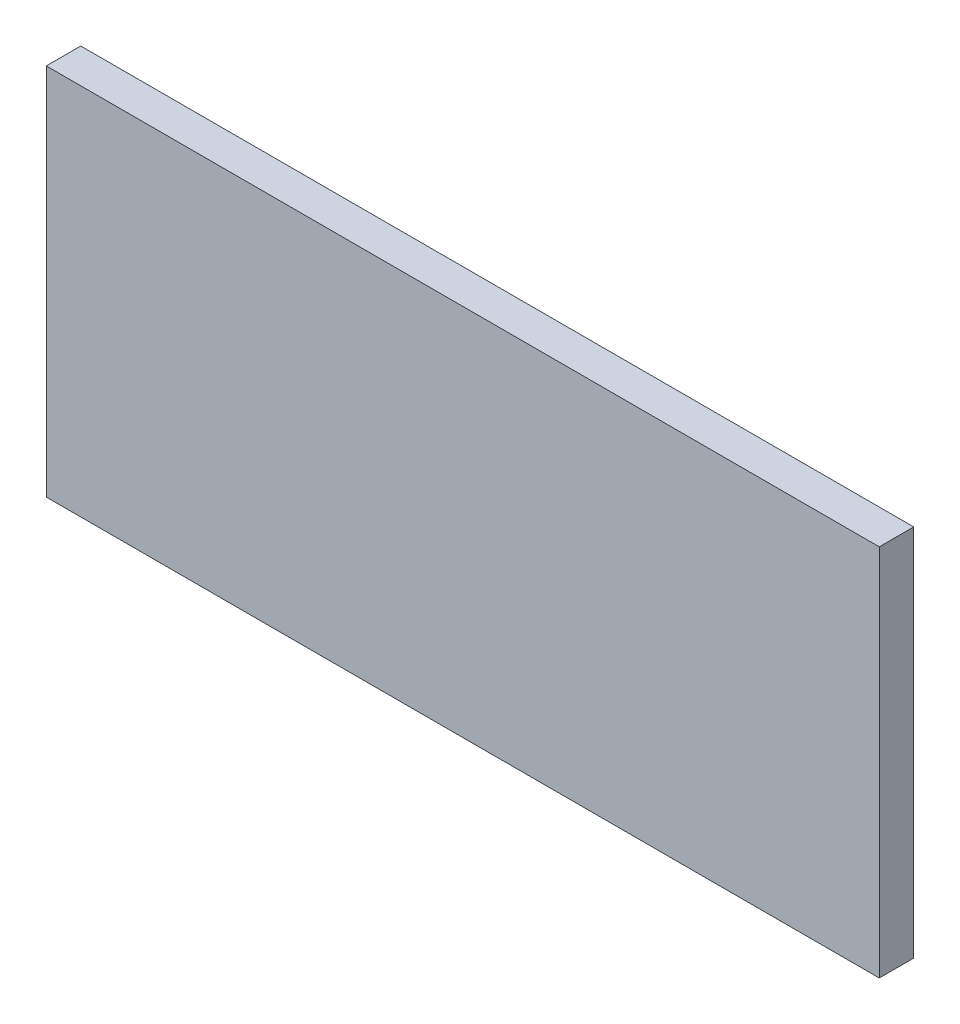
ISO-10303-21;
HEADER;
FILE_DESCRIPTION(('STEP AP214'),'2;1');
FILE_NAME('part.step','',(''),(''),'','','');
FILE_SCHEMA(('AUTOMOTIVE_DESIGN { 1 0 10303 214 1 1 1 1 }'));
ENDSEC;
DATA;
#1=APPLICATION_CONTEXT('core data for automotive mechanical design processes');
#2=APPLICATION_PROTOCOL_DEFINITION('international standard','automotive_design',2000,#1);
#3=PRODUCT_CONTEXT('',#1,'mechanical');
#4=PRODUCT('Part','Part','',(#3));
#5=PRODUCT_RELATED_PRODUCT_CATEGORY('part','',(#4));
#6=PRODUCT_DEFINITION_FORMATION('','',#4);
#7=PRODUCT_DEFINITION_CONTEXT('part definition',#1,'design');
#8=PRODUCT_DEFINITION('design','',#6,#7);
#9=PRODUCT_DEFINITION_SHAPE('','',#8);
#10=(LENGTH_UNIT() NAMED_UNIT(*) SI_UNIT(.MILLI.,.METRE.));
#11=(NAMED_UNIT(*) PLANE_ANGLE_UNIT() SI_UNIT($,.RADIAN.));
#12=(NAMED_UNIT(*) SI_UNIT($,.STERADIAN.) SOLID_ANGLE_UNIT());
#13=UNCERTAINTY_MEASURE_WITH_UNIT(LENGTH_MEASURE(1.E-05),#10,'distance_accuracy_value','');
#14=(GEOMETRIC_REPRESENTATION_CONTEXT(3) GLOBAL_UNCERTAINTY_ASSIGNED_CONTEXT((#13)) GLOBAL_UNIT_ASSIGNED_CONTEXT((#10,
#11,#12)) REPRESENTATION_CONTEXT('',''));
#15=CARTESIAN_POINT('',(0.,0.,0.));
#16=DIRECTION('',(0.,0.,1.));
#17=DIRECTION('',(1.,0.,0.));
#18=AXIS2_PLACEMENT_3D('',#15,#16,#17);
#19=CARTESIAN_POINT('',(0.,0.,12.));
#20=DIRECTION('',(1.,0.,0.));
#21=DIRECTION('',(0.,0.,-1.));
#22=AXIS2_PLACEMENT_3D('',#19,#20,#21);
#23=PLANE('',#22);
#24=DIRECTION('',(0.,-1.,0.));
#25=VECTOR('',#24,1.);
#26=CARTESIAN_POINT('',(0.,0.,0.));
#27=LINE('',#26,#25);
#28=CARTESIAN_POINT('',(0.,130.,0.));
#29=VERTEX_POINT('',#28);
#30=CARTESIAN_POINT('',(0.,0.,0.));
#31=VERTEX_POINT('',#30);
#32=EDGE_CURVE('E74',#29,#31,#27,.T.);
#33=ORIENTED_EDGE('',*,*,#32,.T.);
#34=DIRECTION('',(0.,0.,-1.));
#35=VECTOR('',#34,1.);
#36=CARTESIAN_POINT('',(0.,0.,12.));
#37=LINE('',#36,#35);
#38=CARTESIAN_POINT('',(0.,0.,12.));
#39=VERTEX_POINT('',#38);
#40=EDGE_CURVE('E11',#39,#31,#37,.T.);
#41=ORIENTED_EDGE('',*,*,#40,.F.);
#42=DIRECTION('',(0.,-1.,0.));
#43=VECTOR('',#42,1.);
#44=CARTESIAN_POINT('',(0.,0.,12.));
#45=LINE('',#44,#43);
#46=CARTESIAN_POINT('',(0.,130.,12.));
#47=VERTEX_POINT('',#46);
#48=EDGE_CURVE('E92',#47,#39,#45,.T.);
#49=ORIENTED_EDGE('',*,*,#48,.F.);
#50=DIRECTION('',(0.,0.,-1.));
#51=VECTOR('',#50,1.);
#52=CARTESIAN_POINT('',(0.,130.,12.));
#53=LINE('',#52,#51);
#54=EDGE_CURVE('E86',#47,#29,#53,.T.);
#55=ORIENTED_EDGE('',*,*,#54,.T.);
#56=EDGE_LOOP('',(#33,#41,#49,#55));
#57=FACE_BOUND('',#56,.T.);
#58=ADVANCED_FACE('F30',(#57),#23,.F.);
#59=CARTESIAN_POINT('',(0.,0.,12.));
#60=DIRECTION('',(0.,1.,0.));
#61=DIRECTION('',(0.,0.,1.));
#62=AXIS2_PLACEMENT_3D('',#59,#60,#61);
#63=PLANE('',#62);
#64=DIRECTION('',(1.,0.,0.));
#65=VECTOR('',#64,1.);
#66=CARTESIAN_POINT('',(0.,0.,0.));
#67=LINE('',#66,#65);
#68=CARTESIAN_POINT('',(290.,0.,0.));
#69=VERTEX_POINT('',#68);
#70=EDGE_CURVE('E70',#31,#69,#67,.T.);
#71=ORIENTED_EDGE('',*,*,#70,.T.);
#72=DIRECTION('',(0.,0.,-1.));
#73=VECTOR('',#72,1.);
#74=CARTESIAN_POINT('',(290.,0.,12.));
#75=LINE('',#74,#73);
#76=CARTESIAN_POINT('',(290.,0.,12.));
#77=VERTEX_POINT('',#76);
#78=EDGE_CURVE('E37',#77,#69,#75,.T.);
#79=ORIENTED_EDGE('',*,*,#78,.F.);
#80=DIRECTION('',(1.,0.,0.));
#81=VECTOR('',#80,1.);
#82=CARTESIAN_POINT('',(0.,0.,12.));
#83=LINE('',#82,#81);
#84=EDGE_CURVE('E82',#39,#77,#83,.T.);
#85=ORIENTED_EDGE('',*,*,#84,.F.);
#86=ORIENTED_EDGE('',*,*,#40,.T.);
#87=EDGE_LOOP('',(#71,#79,#85,#86));
#88=FACE_BOUND('',#87,.T.);
#89=ADVANCED_FACE('F81',(#88),#63,.F.);
#90=CARTESIAN_POINT('',(290.,0.,12.));
#91=DIRECTION('',(-1.,0.,0.));
#92=DIRECTION('',(0.,0.,1.));
#93=AXIS2_PLACEMENT_3D('',#90,#91,#92);
#94=PLANE('',#93);
#95=DIRECTION('',(0.,1.,0.));
#96=VECTOR('',#95,1.);
#97=CARTESIAN_POINT('',(290.,0.,0.));
#98=LINE('',#97,#96);
#99=CARTESIAN_POINT('',(290.,130.,0.));
#100=VERTEX_POINT('',#99);
#101=EDGE_CURVE('E75',#69,#100,#98,.T.);
#102=ORIENTED_EDGE('',*,*,#101,.T.);
#103=DIRECTION('',(0.,0.,-1.));
#104=VECTOR('',#103,1.);
#105=CARTESIAN_POINT('',(290.,130.,12.));
#106=LINE('',#105,#104);
#107=CARTESIAN_POINT('',(290.,130.,12.));
#108=VERTEX_POINT('',#107);
#109=EDGE_CURVE('E98',#108,#100,#106,.T.);
#110=ORIENTED_EDGE('',*,*,#109,.F.);
#111=DIRECTION('',(0.,1.,0.));
#112=VECTOR('',#111,1.);
#113=CARTESIAN_POINT('',(290.,0.,12.));
#114=LINE('',#113,#112);
#115=EDGE_CURVE('E49',#77,#108,#114,.T.);
#116=ORIENTED_EDGE('',*,*,#115,.F.);
#117=ORIENTED_EDGE('',*,*,#78,.T.);
#118=EDGE_LOOP('',(#102,#110,#116,#117));
#119=FACE_BOUND('',#118,.T.);
#120=ADVANCED_FACE('F101',(#119),#94,.F.);
#121=CARTESIAN_POINT('',(0.,130.,12.));
#122=DIRECTION('',(0.,-1.,0.));
#123=DIRECTION('',(0.,0.,-1.));
#124=AXIS2_PLACEMENT_3D('',#121,#122,#123);
#125=PLANE('',#124);
#126=DIRECTION('',(-1.,0.,0.));
#127=VECTOR('',#126,1.);
#128=CARTESIAN_POINT('',(0.,130.,0.));
#129=LINE('',#128,#127);
#130=EDGE_CURVE('E90',#100,#29,#129,.T.);
#131=ORIENTED_EDGE('',*,*,#130,.T.);
#132=ORIENTED_EDGE('',*,*,#54,.F.);
#133=DIRECTION('',(-1.,0.,0.));
#134=VECTOR('',#133,1.);
#135=CARTESIAN_POINT('',(0.,130.,12.));
#136=LINE('',#135,#134);
#137=EDGE_CURVE('E44',#108,#47,#136,.T.);
#138=ORIENTED_EDGE('',*,*,#137,.F.);
#139=ORIENTED_EDGE('',*,*,#109,.T.);
#140=EDGE_LOOP('',(#131,#132,#138,#139));
#141=FACE_BOUND('',#140,.T.);
#142=ADVANCED_FACE('F103',(#141),#125,.F.);
#143=CARTESIAN_POINT('',(0.,130.,12.));
#144=DIRECTION('',(0.,0.,-1.));
#145=DIRECTION('',(-1.,0.,0.));
#146=AXIS2_PLACEMENT_3D('',#143,#144,#145);
#147=PLANE('',#146);
#148=ORIENTED_EDGE('',*,*,#48,.T.);
#149=ORIENTED_EDGE('',*,*,#84,.T.);
#150=ORIENTED_EDGE('',*,*,#115,.T.);
#151=ORIENTED_EDGE('',*,*,#137,.T.);
#152=EDGE_LOOP('',(#148,#149,#150,#151));
#153=FACE_BOUND('',#152,.T.);
#154=ADVANCED_FACE('F104',(#153),#147,.F.);
#155=CARTESIAN_POINT('',(0.,130.,0.));
#156=DIRECTION('',(0.,0.,-1.));
#157=DIRECTION('',(-1.,0.,0.));
#158=AXIS2_PLACEMENT_3D('',#155,#156,#157);
#159=PLANE('',#158);
#160=ORIENTED_EDGE('',*,*,#32,.F.);
#161=ORIENTED_EDGE('',*,*,#130,.F.);
#162=ORIENTED_EDGE('',*,*,#101,.F.);
#163=ORIENTED_EDGE('',*,*,#70,.F.);
#164=EDGE_LOOP('',(#160,#161,#162,#163));
#165=FACE_BOUND('',#164,.T.);
#166=ADVANCED_FACE('F71',(#165),#159,.T.);
#167=CLOSED_SHELL('',(#58,#89,#120,#142,#154,#166));
#168=MANIFOLD_SOLID_BREP('B2',#167);
#169=ADVANCED_BREP_SHAPE_REPRESENTATION('',(#18,#168),#14);
#170=SHAPE_DEFINITION_REPRESENTATION(#9,#169);
ENDSEC;
END-ISO-10303-21;
